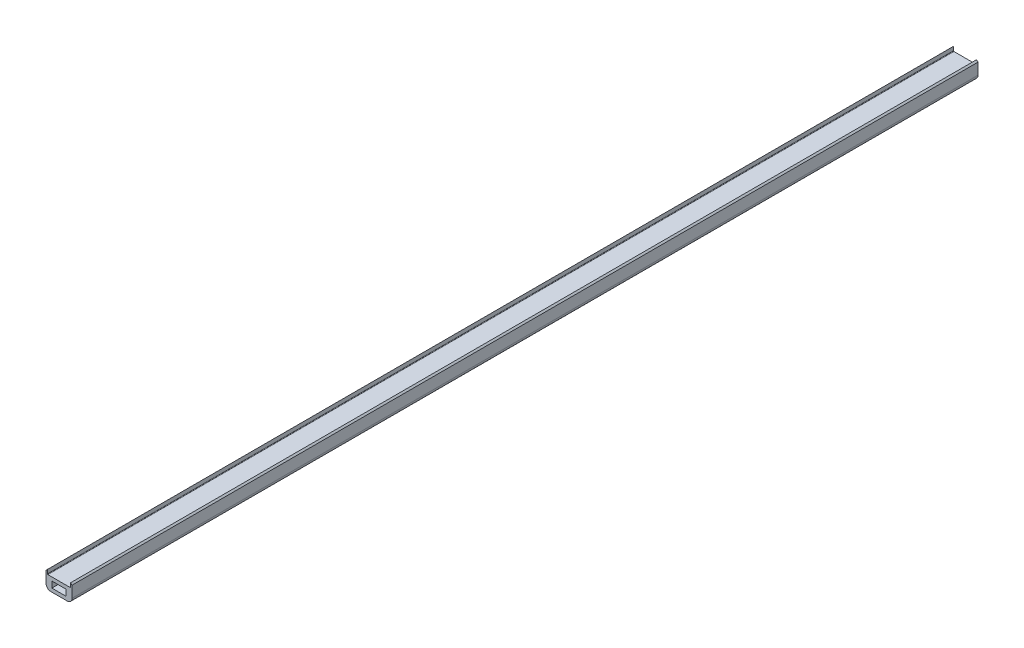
ISO-10303-21;
HEADER;
FILE_DESCRIPTION(('STEP AP214'),'2;1');
FILE_NAME('part.step','',(''),(''),'','','');
FILE_SCHEMA(('AUTOMOTIVE_DESIGN { 1 0 10303 214 1 1 1 1 }'));
ENDSEC;
DATA;
#1=APPLICATION_CONTEXT('core data for automotive mechanical design processes');
#2=APPLICATION_PROTOCOL_DEFINITION('international standard','automotive_design',2000,#1);
#3=PRODUCT_CONTEXT('',#1,'mechanical');
#4=PRODUCT('Part','Part','',(#3));
#5=PRODUCT_RELATED_PRODUCT_CATEGORY('part','',(#4));
#6=PRODUCT_DEFINITION_FORMATION('','',#4);
#7=PRODUCT_DEFINITION_CONTEXT('part definition',#1,'design');
#8=PRODUCT_DEFINITION('design','',#6,#7);
#9=PRODUCT_DEFINITION_SHAPE('','',#8);
#10=(LENGTH_UNIT() NAMED_UNIT(*) SI_UNIT(.MILLI.,.METRE.));
#11=(NAMED_UNIT(*) PLANE_ANGLE_UNIT() SI_UNIT($,.RADIAN.));
#12=(NAMED_UNIT(*) SI_UNIT($,.STERADIAN.) SOLID_ANGLE_UNIT());
#13=UNCERTAINTY_MEASURE_WITH_UNIT(LENGTH_MEASURE(1.E-05),#10,'distance_accuracy_value','');
#14=(GEOMETRIC_REPRESENTATION_CONTEXT(3) GLOBAL_UNCERTAINTY_ASSIGNED_CONTEXT((#13)) GLOBAL_UNIT_ASSIGNED_CONTEXT((#10,
#11,#12)) REPRESENTATION_CONTEXT('',''));
#15=CARTESIAN_POINT('',(0.,0.,0.));
#16=DIRECTION('',(0.,0.,1.));
#17=DIRECTION('',(1.,0.,0.));
#18=AXIS2_PLACEMENT_3D('',#15,#16,#17);
#19=CARTESIAN_POINT('',(-24.5,3.02774114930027,-960.));
#20=DIRECTION('',(-1.,0.,0.));
#21=DIRECTION('',(0.,0.,-1.));
#22=AXIS2_PLACEMENT_3D('',#19,#20,#21);
#23=PLANE('',#22);
#24=DIRECTION('',(0.,1.,0.));
#25=VECTOR('',#24,1.);
#26=CARTESIAN_POINT('',(-24.5,3.02774114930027,960.));
#27=LINE('',#26,#25);
#28=CARTESIAN_POINT('',(-24.5,-4.99999999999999,960.));
#29=VERTEX_POINT('',#28);
#30=CARTESIAN_POINT('',(-24.5,3.02774114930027,960.));
#31=VERTEX_POINT('',#30);
#32=EDGE_CURVE('E180',#29,#31,#27,.T.);
#33=ORIENTED_EDGE('',*,*,#32,.F.);
#34=DIRECTION('',(0.,0.,1.));
#35=VECTOR('',#34,1.);
#36=CARTESIAN_POINT('',(-24.5,-4.99999999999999,-960.));
#37=LINE('',#36,#35);
#38=CARTESIAN_POINT('',(-24.5,-4.99999999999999,-960.));
#39=VERTEX_POINT('',#38);
#40=EDGE_CURVE('E207',#39,#29,#37,.T.);
#41=ORIENTED_EDGE('',*,*,#40,.F.);
#42=DIRECTION('',(0.,1.,0.));
#43=VECTOR('',#42,1.);
#44=CARTESIAN_POINT('',(-24.5,3.02774114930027,-960.));
#45=LINE('',#44,#43);
#46=CARTESIAN_POINT('',(-24.5,3.02774114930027,-960.));
#47=VERTEX_POINT('',#46);
#48=EDGE_CURVE('E183',#39,#47,#45,.T.);
#49=ORIENTED_EDGE('',*,*,#48,.T.);
#50=DIRECTION('',(0.,0.,1.));
#51=VECTOR('',#50,1.);
#52=CARTESIAN_POINT('',(-24.5,3.02774114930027,-960.));
#53=LINE('',#52,#51);
#54=EDGE_CURVE('E243',#47,#31,#53,.T.);
#55=ORIENTED_EDGE('',*,*,#54,.T.);
#56=EDGE_LOOP('',(#33,#41,#49,#55));
#57=FACE_BOUND('',#56,.T.);
#58=ADVANCED_FACE('F41',(#57),#23,.F.);
#59=CARTESIAN_POINT('',(-27.5,3.02774114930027,-960.));
#60=DIRECTION('',(1.,0.,0.));
#61=DIRECTION('',(0.,1.,0.));
#62=AXIS2_PLACEMENT_3D('',#59,#60,#61);
#63=PLANE('',#62);
#64=DIRECTION('',(0.,-1.,0.));
#65=VECTOR('',#64,1.);
#66=CARTESIAN_POINT('',(-27.5,3.02774114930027,-960.));
#67=LINE('',#66,#65);
#68=CARTESIAN_POINT('',(-27.5,0.0277411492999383,-960.));
#69=VERTEX_POINT('',#68);
#70=CARTESIAN_POINT('',(-27.5,-24.0022588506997,-960.));
#71=VERTEX_POINT('',#70);
#72=EDGE_CURVE('E186',#69,#71,#67,.T.);
#73=ORIENTED_EDGE('',*,*,#72,.T.);
#74=DIRECTION('',(0.,0.,1.));
#75=VECTOR('',#74,1.);
#76=CARTESIAN_POINT('',(-27.5,-24.0022588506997,-960.));
#77=LINE('',#76,#75);
#78=CARTESIAN_POINT('',(-27.5,-24.0022588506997,960.));
#79=VERTEX_POINT('',#78);
#80=EDGE_CURVE('E256',#79,#71,#77,.F.);
#81=ORIENTED_EDGE('',*,*,#80,.F.);
#82=DIRECTION('',(0.,-1.,0.));
#83=VECTOR('',#82,1.);
#84=CARTESIAN_POINT('',(-27.5,3.02774114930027,960.));
#85=LINE('',#84,#83);
#86=CARTESIAN_POINT('',(-27.5,0.0277411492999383,960.));
#87=VERTEX_POINT('',#86);
#88=EDGE_CURVE('E210',#87,#79,#85,.T.);
#89=ORIENTED_EDGE('',*,*,#88,.F.);
#90=DIRECTION('',(0.,0.,1.));
#91=VECTOR('',#90,1.);
#92=CARTESIAN_POINT('',(-27.5,0.0277411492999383,-960.));
#93=LINE('',#92,#91);
#94=EDGE_CURVE('E277',#69,#87,#93,.T.);
#95=ORIENTED_EDGE('',*,*,#94,.F.);
#96=EDGE_LOOP('',(#73,#81,#89,#95));
#97=FACE_BOUND('',#96,.T.);
#98=ADVANCED_FACE('F302',(#97),#63,.F.);
#99=CARTESIAN_POINT('',(27.5,-34.0022588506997,-960.));
#100=DIRECTION('',(0.,1.,0.));
#101=DIRECTION('',(-1.,0.,0.));
#102=AXIS2_PLACEMENT_3D('',#99,#100,#101);
#103=PLANE('',#102);
#104=DIRECTION('',(1.,0.,0.));
#105=VECTOR('',#104,1.);
#106=CARTESIAN_POINT('',(27.5,-34.0022588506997,-960.));
#107=LINE('',#106,#105);
#108=CARTESIAN_POINT('',(-17.5,-34.0022588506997,-960.));
#109=VERTEX_POINT('',#108);
#110=CARTESIAN_POINT('',(17.5,-34.0022588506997,-960.));
#111=VERTEX_POINT('',#110);
#112=EDGE_CURVE('E190',#109,#111,#107,.T.);
#113=ORIENTED_EDGE('',*,*,#112,.T.);
#114=DIRECTION('',(0.,0.,1.));
#115=VECTOR('',#114,1.);
#116=CARTESIAN_POINT('',(17.5,-34.0022588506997,-960.));
#117=LINE('',#116,#115);
#118=CARTESIAN_POINT('',(17.5,-34.0022588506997,960.));
#119=VERTEX_POINT('',#118);
#120=EDGE_CURVE('E246',#119,#111,#117,.F.);
#121=ORIENTED_EDGE('',*,*,#120,.F.);
#122=DIRECTION('',(1.,0.,0.));
#123=VECTOR('',#122,1.);
#124=CARTESIAN_POINT('',(27.5,-34.0022588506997,960.));
#125=LINE('',#124,#123);
#126=CARTESIAN_POINT('',(-17.5,-34.0022588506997,960.));
#127=VERTEX_POINT('',#126);
#128=EDGE_CURVE('E213',#127,#119,#125,.T.);
#129=ORIENTED_EDGE('',*,*,#128,.F.);
#130=DIRECTION('',(0.,0.,1.));
#131=VECTOR('',#130,1.);
#132=CARTESIAN_POINT('',(-17.5,-34.0022588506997,-960.));
#133=LINE('',#132,#131);
#134=EDGE_CURVE('E249',#109,#127,#133,.T.);
#135=ORIENTED_EDGE('',*,*,#134,.F.);
#136=EDGE_LOOP('',(#113,#121,#129,#135));
#137=FACE_BOUND('',#136,.T.);
#138=ADVANCED_FACE('F308',(#137),#103,.F.);
#139=CARTESIAN_POINT('',(27.5,3.02774114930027,-960.));
#140=DIRECTION('',(-1.,0.,0.));
#141=DIRECTION('',(0.,0.,-1.));
#142=AXIS2_PLACEMENT_3D('',#139,#140,#141);
#143=PLANE('',#142);
#144=DIRECTION('',(0.,1.,0.));
#145=VECTOR('',#144,1.);
#146=CARTESIAN_POINT('',(27.5,3.02774114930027,960.));
#147=LINE('',#146,#145);
#148=CARTESIAN_POINT('',(27.5,-24.0022588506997,960.));
#149=VERTEX_POINT('',#148);
#150=CARTESIAN_POINT('',(27.5,0.0277411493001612,960.));
#151=VERTEX_POINT('',#150);
#152=EDGE_CURVE('E216',#149,#151,#147,.T.);
#153=ORIENTED_EDGE('',*,*,#152,.F.);
#154=DIRECTION('',(0.,0.,1.));
#155=VECTOR('',#154,1.);
#156=CARTESIAN_POINT('',(27.5,-24.0022588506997,-960.));
#157=LINE('',#156,#155);
#158=CARTESIAN_POINT('',(27.5,-24.0022588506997,-960.));
#159=VERTEX_POINT('',#158);
#160=EDGE_CURVE('E263',#159,#149,#157,.T.);
#161=ORIENTED_EDGE('',*,*,#160,.F.);
#162=DIRECTION('',(0.,1.,0.));
#163=VECTOR('',#162,1.);
#164=CARTESIAN_POINT('',(27.5,3.02774114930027,-960.));
#165=LINE('',#164,#163);
#166=CARTESIAN_POINT('',(27.5,0.0277411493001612,-960.));
#167=VERTEX_POINT('',#166);
#168=EDGE_CURVE('E193',#159,#167,#165,.T.);
#169=ORIENTED_EDGE('',*,*,#168,.T.);
#170=DIRECTION('',(0.,0.,-1.));
#171=VECTOR('',#170,1.);
#172=CARTESIAN_POINT('',(27.5,0.0277411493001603,-960.));
#173=LINE('',#172,#171);
#174=EDGE_CURVE('E270',#151,#167,#173,.T.);
#175=ORIENTED_EDGE('',*,*,#174,.F.);
#176=EDGE_LOOP('',(#153,#161,#169,#175));
#177=FACE_BOUND('',#176,.T.);
#178=ADVANCED_FACE('F335',(#177),#143,.F.);
#179=CARTESIAN_POINT('',(24.5,3.02774114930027,-960.));
#180=DIRECTION('',(1.,0.,0.));
#181=DIRECTION('',(0.,0.,1.));
#182=AXIS2_PLACEMENT_3D('',#179,#180,#181);
#183=PLANE('',#182);
#184=DIRECTION('',(0.,-1.,0.));
#185=VECTOR('',#184,1.);
#186=CARTESIAN_POINT('',(24.5,3.02774114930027,960.));
#187=LINE('',#186,#185);
#188=CARTESIAN_POINT('',(24.5,3.02774114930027,960.));
#189=VERTEX_POINT('',#188);
#190=CARTESIAN_POINT('',(24.5,-4.99999999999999,960.));
#191=VERTEX_POINT('',#190);
#192=EDGE_CURVE('E219',#189,#191,#187,.T.);
#193=ORIENTED_EDGE('',*,*,#192,.F.);
#194=DIRECTION('',(0.,0.,1.));
#195=VECTOR('',#194,1.);
#196=CARTESIAN_POINT('',(24.5,3.02774114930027,-960.));
#197=LINE('',#196,#195);
#198=CARTESIAN_POINT('',(24.5,3.02774114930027,-960.));
#199=VERTEX_POINT('',#198);
#200=EDGE_CURVE('E240',#199,#189,#197,.T.);
#201=ORIENTED_EDGE('',*,*,#200,.F.);
#202=DIRECTION('',(0.,-1.,0.));
#203=VECTOR('',#202,1.);
#204=CARTESIAN_POINT('',(24.5,3.02774114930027,-960.));
#205=LINE('',#204,#203);
#206=CARTESIAN_POINT('',(24.5,-4.99999999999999,-960.));
#207=VERTEX_POINT('',#206);
#208=EDGE_CURVE('E196',#199,#207,#205,.T.);
#209=ORIENTED_EDGE('',*,*,#208,.T.);
#210=DIRECTION('',(0.,0.,1.));
#211=VECTOR('',#210,1.);
#212=CARTESIAN_POINT('',(24.5,-4.99999999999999,-960.));
#213=LINE('',#212,#211);
#214=EDGE_CURVE('E237',#207,#191,#213,.T.);
#215=ORIENTED_EDGE('',*,*,#214,.T.);
#216=EDGE_LOOP('',(#193,#201,#209,#215));
#217=FACE_BOUND('',#216,.T.);
#218=ADVANCED_FACE('F332',(#217),#183,.F.);
#219=CARTESIAN_POINT('',(23.5,-4.99999999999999,-960.));
#220=DIRECTION('',(0.,0.,1.));
#221=DIRECTION('',(-1.,0.,0.));
#222=AXIS2_PLACEMENT_3D('',#219,#220,#221);
#223=CYLINDRICAL_SURFACE('',#222,1.00000000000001);
#224=CARTESIAN_POINT('',(23.5,-4.99999999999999,960.));
#225=DIRECTION('',(0.,0.,-1.));
#226=DIRECTION('',(1.,0.,0.));
#227=AXIS2_PLACEMENT_3D('',#224,#225,#226);
#228=CIRCLE('',#227,1.00000000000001);
#229=CARTESIAN_POINT('',(23.5,-6.,960.));
#230=VERTEX_POINT('',#229);
#231=EDGE_CURVE('E222',#191,#230,#228,.T.);
#232=ORIENTED_EDGE('',*,*,#231,.F.);
#233=ORIENTED_EDGE('',*,*,#214,.F.);
#234=CARTESIAN_POINT('',(23.5,-4.99999999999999,-960.));
#235=DIRECTION('',(0.,0.,-1.));
#236=DIRECTION('',(1.,0.,0.));
#237=AXIS2_PLACEMENT_3D('',#234,#235,#236);
#238=CIRCLE('',#237,1.00000000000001);
#239=CARTESIAN_POINT('',(23.5,-6.,-960.));
#240=VERTEX_POINT('',#239);
#241=EDGE_CURVE('E199',#207,#240,#238,.T.);
#242=ORIENTED_EDGE('',*,*,#241,.T.);
#243=DIRECTION('',(0.,0.,1.));
#244=VECTOR('',#243,1.);
#245=CARTESIAN_POINT('',(23.5,-6.,-960.));
#246=LINE('',#245,#244);
#247=EDGE_CURVE('E234',#240,#230,#246,.T.);
#248=ORIENTED_EDGE('',*,*,#247,.T.);
#249=EDGE_LOOP('',(#232,#233,#242,#248));
#250=FACE_BOUND('',#249,.T.);
#251=ADVANCED_FACE('F356',(#250),#223,.F.);
#252=CARTESIAN_POINT('',(-23.5,-6.,-960.));
#253=DIRECTION('',(0.,-1.,0.));
#254=DIRECTION('',(0.,0.,1.));
#255=AXIS2_PLACEMENT_3D('',#252,#253,#254);
#256=PLANE('',#255);
#257=DIRECTION('',(-1.,0.,0.));
#258=VECTOR('',#257,1.);
#259=CARTESIAN_POINT('',(-23.5,-6.,960.));
#260=LINE('',#259,#258);
#261=CARTESIAN_POINT('',(-23.5,-6.,960.));
#262=VERTEX_POINT('',#261);
#263=EDGE_CURVE('E225',#230,#262,#260,.T.);
#264=ORIENTED_EDGE('',*,*,#263,.F.);
#265=ORIENTED_EDGE('',*,*,#247,.F.);
#266=DIRECTION('',(-1.,0.,0.));
#267=VECTOR('',#266,1.);
#268=CARTESIAN_POINT('',(-23.5,-6.,-960.));
#269=LINE('',#268,#267);
#270=CARTESIAN_POINT('',(-23.5,-6.,-960.));
#271=VERTEX_POINT('',#270);
#272=EDGE_CURVE('E202',#240,#271,#269,.T.);
#273=ORIENTED_EDGE('',*,*,#272,.T.);
#274=DIRECTION('',(0.,0.,1.));
#275=VECTOR('',#274,1.);
#276=CARTESIAN_POINT('',(-23.5,-6.,-960.));
#277=LINE('',#276,#275);
#278=EDGE_CURVE('E231',#271,#262,#277,.T.);
#279=ORIENTED_EDGE('',*,*,#278,.T.);
#280=EDGE_LOOP('',(#264,#265,#273,#279));
#281=FACE_BOUND('',#280,.T.);
#282=ADVANCED_FACE('F354',(#281),#256,.F.);
#283=CARTESIAN_POINT('',(-23.5,-4.99999999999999,-960.));
#284=DIRECTION('',(0.,0.,1.));
#285=DIRECTION('',(-1.,0.,0.));
#286=AXIS2_PLACEMENT_3D('',#283,#284,#285);
#287=CYLINDRICAL_SURFACE('',#286,1.00000000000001);
#288=CARTESIAN_POINT('',(-23.5,-4.99999999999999,960.));
#289=DIRECTION('',(0.,0.,-1.));
#290=DIRECTION('',(-1.,0.,0.));
#291=AXIS2_PLACEMENT_3D('',#288,#289,#290);
#292=CIRCLE('',#291,1.00000000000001);
#293=EDGE_CURVE('E187',#262,#29,#292,.T.);
#294=ORIENTED_EDGE('',*,*,#293,.F.);
#295=ORIENTED_EDGE('',*,*,#278,.F.);
#296=CARTESIAN_POINT('',(-23.5,-4.99999999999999,-960.));
#297=DIRECTION('',(0.,0.,-1.));
#298=DIRECTION('',(-1.,0.,0.));
#299=AXIS2_PLACEMENT_3D('',#296,#297,#298);
#300=CIRCLE('',#299,1.00000000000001);
#301=EDGE_CURVE('E205',#271,#39,#300,.T.);
#302=ORIENTED_EDGE('',*,*,#301,.T.);
#303=ORIENTED_EDGE('',*,*,#40,.T.);
#304=EDGE_LOOP('',(#294,#295,#302,#303));
#305=FACE_BOUND('',#304,.T.);
#306=ADVANCED_FACE('F352',(#305),#287,.F.);
#307=CARTESIAN_POINT('',(-23.5,-4.99999999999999,-960.));
#308=DIRECTION('',(0.,0.,1.));
#309=DIRECTION('',(-1.,0.,0.));
#310=AXIS2_PLACEMENT_3D('',#307,#308,#309);
#311=PLANE('',#310);
#312=DIRECTION('',(-1.,0.,0.));
#313=VECTOR('',#312,1.);
#314=CARTESIAN_POINT('',(-15.,-13.5011294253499,-960.));
#315=LINE('',#314,#313);
#316=CARTESIAN_POINT('',(15.,-13.5011294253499,-960.));
#317=VERTEX_POINT('',#316);
#318=CARTESIAN_POINT('',(-15.,-13.5011294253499,-960.));
#319=VERTEX_POINT('',#318);
#320=EDGE_CURVE('E157',#317,#319,#315,.T.);
#321=ORIENTED_EDGE('',*,*,#320,.T.);
#322=DIRECTION('',(0.,-1.,0.));
#323=VECTOR('',#322,1.);
#324=CARTESIAN_POINT('',(-15.,-13.5011294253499,-960.));
#325=LINE('',#324,#323);
#326=CARTESIAN_POINT('',(-15.,-26.5011294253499,-960.));
#327=VERTEX_POINT('',#326);
#328=EDGE_CURVE('E164',#319,#327,#325,.T.);
#329=ORIENTED_EDGE('',*,*,#328,.T.);
#330=DIRECTION('',(1.,0.,0.));
#331=VECTOR('',#330,1.);
#332=CARTESIAN_POINT('',(-15.,-26.5011294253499,-960.));
#333=LINE('',#332,#331);
#334=CARTESIAN_POINT('',(15.,-26.5011294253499,-960.));
#335=VERTEX_POINT('',#334);
#336=EDGE_CURVE('E169',#327,#335,#333,.T.);
#337=ORIENTED_EDGE('',*,*,#336,.T.);
#338=DIRECTION('',(0.,1.,0.));
#339=VECTOR('',#338,1.);
#340=CARTESIAN_POINT('',(15.,-13.5011294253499,-960.));
#341=LINE('',#340,#339);
#342=EDGE_CURVE('E173',#335,#317,#341,.T.);
#343=ORIENTED_EDGE('',*,*,#342,.T.);
#344=EDGE_LOOP('',(#321,#329,#337,#343));
#345=FACE_BOUND('',#344,.T.);
#346=ORIENTED_EDGE('',*,*,#168,.F.);
#347=CARTESIAN_POINT('',(17.5,-24.0022588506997,-960.));
#348=DIRECTION('',(0.,0.,-1.));
#349=DIRECTION('',(-1.,0.,0.));
#350=AXIS2_PLACEMENT_3D('',#347,#348,#349);
#351=CIRCLE('',#350,10.);
#352=EDGE_CURVE('E259',#111,#159,#351,.F.);
#353=ORIENTED_EDGE('',*,*,#352,.F.);
#354=ORIENTED_EDGE('',*,*,#112,.F.);
#355=CARTESIAN_POINT('',(-17.5,-24.0022588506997,-960.));
#356=DIRECTION('',(0.,0.,-1.));
#357=DIRECTION('',(-1.,0.,0.));
#358=AXIS2_PLACEMENT_3D('',#355,#356,#357);
#359=CIRCLE('',#358,10.);
#360=EDGE_CURVE('E261',#71,#109,#359,.F.);
#361=ORIENTED_EDGE('',*,*,#360,.F.);
#362=ORIENTED_EDGE('',*,*,#72,.F.);
#363=DIRECTION('',(0.707106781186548,0.707106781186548,0.));
#364=VECTOR('',#363,1.);
#365=CARTESIAN_POINT('',(-27.5,0.0277411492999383,-960.));
#366=LINE('',#365,#364);
#367=EDGE_CURVE('E273',#47,#69,#366,.F.);
#368=ORIENTED_EDGE('',*,*,#367,.F.);
#369=ORIENTED_EDGE('',*,*,#48,.F.);
#370=ORIENTED_EDGE('',*,*,#301,.F.);
#371=ORIENTED_EDGE('',*,*,#272,.F.);
#372=ORIENTED_EDGE('',*,*,#241,.F.);
#373=ORIENTED_EDGE('',*,*,#208,.F.);
#374=DIRECTION('',(0.707106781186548,-0.707106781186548,0.));
#375=VECTOR('',#374,1.);
#376=CARTESIAN_POINT('',(24.4999999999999,3.02774114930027,-960.));
#377=LINE('',#376,#375);
#378=EDGE_CURVE('E275',#167,#199,#377,.F.);
#379=ORIENTED_EDGE('',*,*,#378,.F.);
#380=EDGE_LOOP('',(#346,#353,#354,#361,#362,#368,#369,#370,#371,#372,#373,#379));
#381=FACE_BOUND('',#380,.T.);
#382=ADVANCED_FACE('F171',(#345,#381),#311,.F.);
#383=CARTESIAN_POINT('',(-23.5,-4.99999999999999,960.));
#384=DIRECTION('',(0.,0.,1.));
#385=DIRECTION('',(-1.,0.,0.));
#386=AXIS2_PLACEMENT_3D('',#383,#384,#385);
#387=PLANE('',#386);
#388=DIRECTION('',(0.,-1.,0.));
#389=VECTOR('',#388,1.);
#390=CARTESIAN_POINT('',(15.,-4.99999999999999,960.));
#391=LINE('',#390,#389);
#392=CARTESIAN_POINT('',(15.,-13.5011294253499,960.));
#393=VERTEX_POINT('',#392);
#394=CARTESIAN_POINT('',(15.,-26.5011294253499,960.));
#395=VERTEX_POINT('',#394);
#396=EDGE_CURVE('E11',#393,#395,#391,.T.);
#397=ORIENTED_EDGE('',*,*,#396,.T.);
#398=DIRECTION('',(-1.,0.,0.));
#399=VECTOR('',#398,1.);
#400=CARTESIAN_POINT('',(-23.5,-26.5011294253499,960.));
#401=LINE('',#400,#399);
#402=CARTESIAN_POINT('',(-15.,-26.5011294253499,960.));
#403=VERTEX_POINT('',#402);
#404=EDGE_CURVE('E49',#395,#403,#401,.T.);
#405=ORIENTED_EDGE('',*,*,#404,.T.);
#406=DIRECTION('',(0.,1.,0.));
#407=VECTOR('',#406,1.);
#408=CARTESIAN_POINT('',(-15.,-4.99999999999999,960.));
#409=LINE('',#408,#407);
#410=CARTESIAN_POINT('',(-15.,-13.5011294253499,960.));
#411=VERTEX_POINT('',#410);
#412=EDGE_CURVE('E281',#403,#411,#409,.T.);
#413=ORIENTED_EDGE('',*,*,#412,.T.);
#414=DIRECTION('',(1.,0.,0.));
#415=VECTOR('',#414,1.);
#416=CARTESIAN_POINT('',(-23.5,-13.5011294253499,960.));
#417=LINE('',#416,#415);
#418=EDGE_CURVE('E159',#411,#393,#417,.T.);
#419=ORIENTED_EDGE('',*,*,#418,.T.);
#420=EDGE_LOOP('',(#397,#405,#413,#419));
#421=FACE_BOUND('',#420,.T.);
#422=ORIENTED_EDGE('',*,*,#192,.T.);
#423=ORIENTED_EDGE('',*,*,#231,.T.);
#424=ORIENTED_EDGE('',*,*,#263,.T.);
#425=ORIENTED_EDGE('',*,*,#293,.T.);
#426=ORIENTED_EDGE('',*,*,#32,.T.);
#427=DIRECTION('',(-0.707106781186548,-0.707106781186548,0.));
#428=VECTOR('',#427,1.);
#429=CARTESIAN_POINT('',(-28.01387057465,-0.486129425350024,960.));
#430=LINE('',#429,#428);
#431=EDGE_CURVE('E266',#87,#31,#430,.F.);
#432=ORIENTED_EDGE('',*,*,#431,.F.);
#433=ORIENTED_EDGE('',*,*,#88,.T.);
#434=CARTESIAN_POINT('',(-17.5,-24.0022588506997,960.));
#435=DIRECTION('',(0.,0.,-1.));
#436=DIRECTION('',(-1.,0.,0.));
#437=AXIS2_PLACEMENT_3D('',#434,#435,#436);
#438=CIRCLE('',#437,10.);
#439=EDGE_CURVE('E254',#127,#79,#438,.T.);
#440=ORIENTED_EDGE('',*,*,#439,.F.);
#441=ORIENTED_EDGE('',*,*,#128,.T.);
#442=CARTESIAN_POINT('',(17.5,-24.0022588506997,960.));
#443=DIRECTION('',(0.,0.,-1.));
#444=DIRECTION('',(-1.,0.,0.));
#445=AXIS2_PLACEMENT_3D('',#442,#443,#444);
#446=CIRCLE('',#445,10.);
#447=EDGE_CURVE('E252',#149,#119,#446,.T.);
#448=ORIENTED_EDGE('',*,*,#447,.F.);
#449=ORIENTED_EDGE('',*,*,#152,.T.);
#450=DIRECTION('',(-0.707106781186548,0.707106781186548,0.));
#451=VECTOR('',#450,1.);
#452=CARTESIAN_POINT('',(4.51387057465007,23.0138705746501,960.));
#453=LINE('',#452,#451);
#454=EDGE_CURVE('E268',#189,#151,#453,.F.);
#455=ORIENTED_EDGE('',*,*,#454,.F.);
#456=EDGE_LOOP('',(#422,#423,#424,#425,#426,#432,#433,#440,#441,#448,#449,#455));
#457=FACE_BOUND('',#456,.T.);
#458=ADVANCED_FACE('F285',(#421,#457),#387,.T.);
#459=CARTESIAN_POINT('',(-17.5,-24.0022588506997,-960.));
#460=DIRECTION('',(0.,0.,1.));
#461=DIRECTION('',(-1.,0.,0.));
#462=AXIS2_PLACEMENT_3D('',#459,#460,#461);
#463=CYLINDRICAL_SURFACE('',#462,10.);
#464=ORIENTED_EDGE('',*,*,#360,.T.);
#465=ORIENTED_EDGE('',*,*,#134,.T.);
#466=ORIENTED_EDGE('',*,*,#439,.T.);
#467=ORIENTED_EDGE('',*,*,#80,.T.);
#468=EDGE_LOOP('',(#464,#465,#466,#467));
#469=FACE_BOUND('',#468,.T.);
#470=ADVANCED_FACE('F314',(#469),#463,.T.);
#471=CARTESIAN_POINT('',(17.5,-24.0022588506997,-960.));
#472=DIRECTION('',(0.,0.,1.));
#473=DIRECTION('',(-1.,0.,0.));
#474=AXIS2_PLACEMENT_3D('',#471,#472,#473);
#475=CYLINDRICAL_SURFACE('',#474,10.);
#476=ORIENTED_EDGE('',*,*,#352,.T.);
#477=ORIENTED_EDGE('',*,*,#160,.T.);
#478=ORIENTED_EDGE('',*,*,#447,.T.);
#479=ORIENTED_EDGE('',*,*,#120,.T.);
#480=EDGE_LOOP('',(#476,#477,#478,#479));
#481=FACE_BOUND('',#480,.T.);
#482=ADVANCED_FACE('F317',(#481),#475,.T.);
#483=CARTESIAN_POINT('',(24.4999999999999,3.02774114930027,-960.));
#484=DIRECTION('',(-0.707106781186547,-0.707106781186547,0.));
#485=DIRECTION('',(0.,0.,1.));
#486=AXIS2_PLACEMENT_3D('',#483,#484,#485);
#487=PLANE('',#486);
#488=ORIENTED_EDGE('',*,*,#378,.T.);
#489=ORIENTED_EDGE('',*,*,#200,.T.);
#490=ORIENTED_EDGE('',*,*,#454,.T.);
#491=ORIENTED_EDGE('',*,*,#174,.T.);
#492=EDGE_LOOP('',(#488,#489,#490,#491));
#493=FACE_BOUND('',#492,.T.);
#494=ADVANCED_FACE('F297',(#493),#487,.F.);
#495=CARTESIAN_POINT('',(-27.5,0.0277411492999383,-960.));
#496=DIRECTION('',(0.707106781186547,-0.707106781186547,0.));
#497=DIRECTION('',(0.,0.,1.));
#498=AXIS2_PLACEMENT_3D('',#495,#496,#497);
#499=PLANE('',#498);
#500=ORIENTED_EDGE('',*,*,#367,.T.);
#501=ORIENTED_EDGE('',*,*,#94,.T.);
#502=ORIENTED_EDGE('',*,*,#431,.T.);
#503=ORIENTED_EDGE('',*,*,#54,.F.);
#504=EDGE_LOOP('',(#500,#501,#502,#503));
#505=FACE_BOUND('',#504,.T.);
#506=ADVANCED_FACE('F43',(#505),#499,.F.);
#507=CARTESIAN_POINT('',(15.,-13.5011294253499,1047.));
#508=DIRECTION('',(1.,0.,0.));
#509=DIRECTION('',(0.,0.,1.));
#510=AXIS2_PLACEMENT_3D('',#507,#508,#509);
#511=PLANE('',#510);
#512=ORIENTED_EDGE('',*,*,#396,.F.);
#513=DIRECTION('',(0.,0.,-1.));
#514=VECTOR('',#513,1.);
#515=CARTESIAN_POINT('',(15.,-13.5011294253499,1047.));
#516=LINE('',#515,#514);
#517=EDGE_CURVE('E56',#393,#317,#516,.T.);
#518=ORIENTED_EDGE('',*,*,#517,.T.);
#519=ORIENTED_EDGE('',*,*,#342,.F.);
#520=DIRECTION('',(0.,0.,-1.));
#521=VECTOR('',#520,1.);
#522=CARTESIAN_POINT('',(15.,-26.5011294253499,1047.));
#523=LINE('',#522,#521);
#524=EDGE_CURVE('E178',#395,#335,#523,.T.);
#525=ORIENTED_EDGE('',*,*,#524,.F.);
#526=EDGE_LOOP('',(#512,#518,#519,#525));
#527=FACE_BOUND('',#526,.T.);
#528=ADVANCED_FACE('F289',(#527),#511,.F.);
#529=CARTESIAN_POINT('',(-15.,-26.5011294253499,1047.));
#530=DIRECTION('',(0.,-1.,0.));
#531=DIRECTION('',(0.,0.,1.));
#532=AXIS2_PLACEMENT_3D('',#529,#530,#531);
#533=PLANE('',#532);
#534=ORIENTED_EDGE('',*,*,#404,.F.);
#535=ORIENTED_EDGE('',*,*,#524,.T.);
#536=ORIENTED_EDGE('',*,*,#336,.F.);
#537=DIRECTION('',(0.,0.,-1.));
#538=VECTOR('',#537,1.);
#539=CARTESIAN_POINT('',(-15.,-26.5011294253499,1047.));
#540=LINE('',#539,#538);
#541=EDGE_CURVE('E161',#403,#327,#540,.T.);
#542=ORIENTED_EDGE('',*,*,#541,.F.);
#543=EDGE_LOOP('',(#534,#535,#536,#542));
#544=FACE_BOUND('',#543,.T.);
#545=ADVANCED_FACE('F288',(#544),#533,.F.);
#546=CARTESIAN_POINT('',(-15.,-13.5011294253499,1047.));
#547=DIRECTION('',(-1.,0.,0.));
#548=DIRECTION('',(0.,-1.,0.));
#549=AXIS2_PLACEMENT_3D('',#546,#547,#548);
#550=PLANE('',#549);
#551=ORIENTED_EDGE('',*,*,#412,.F.);
#552=ORIENTED_EDGE('',*,*,#541,.T.);
#553=ORIENTED_EDGE('',*,*,#328,.F.);
#554=DIRECTION('',(0.,0.,-1.));
#555=VECTOR('',#554,1.);
#556=CARTESIAN_POINT('',(-15.,-13.5011294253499,1047.));
#557=LINE('',#556,#555);
#558=EDGE_CURVE('E64',#411,#319,#557,.T.);
#559=ORIENTED_EDGE('',*,*,#558,.F.);
#560=EDGE_LOOP('',(#551,#552,#553,#559));
#561=FACE_BOUND('',#560,.T.);
#562=ADVANCED_FACE('F165',(#561),#550,.F.);
#563=CARTESIAN_POINT('',(-15.,-13.5011294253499,1047.));
#564=DIRECTION('',(0.,1.,0.));
#565=DIRECTION('',(0.,0.,-1.));
#566=AXIS2_PLACEMENT_3D('',#563,#564,#565);
#567=PLANE('',#566);
#568=ORIENTED_EDGE('',*,*,#418,.F.);
#569=ORIENTED_EDGE('',*,*,#558,.T.);
#570=ORIENTED_EDGE('',*,*,#320,.F.);
#571=ORIENTED_EDGE('',*,*,#517,.F.);
#572=EDGE_LOOP('',(#568,#569,#570,#571));
#573=FACE_BOUND('',#572,.T.);
#574=ADVANCED_FACE('F155',(#573),#567,.F.);
#575=CLOSED_SHELL('',(#58,#98,#138,#178,#218,#251,#282,#306,#382,#458,#470,#482,#494,#506,#528,
#545,#562,#574));
#576=MANIFOLD_SOLID_BREP('B2',#575);
#577=ADVANCED_BREP_SHAPE_REPRESENTATION('',(#18,#576),#14);
#578=SHAPE_DEFINITION_REPRESENTATION(#9,#577);
ENDSEC;
END-ISO-10303-21;
